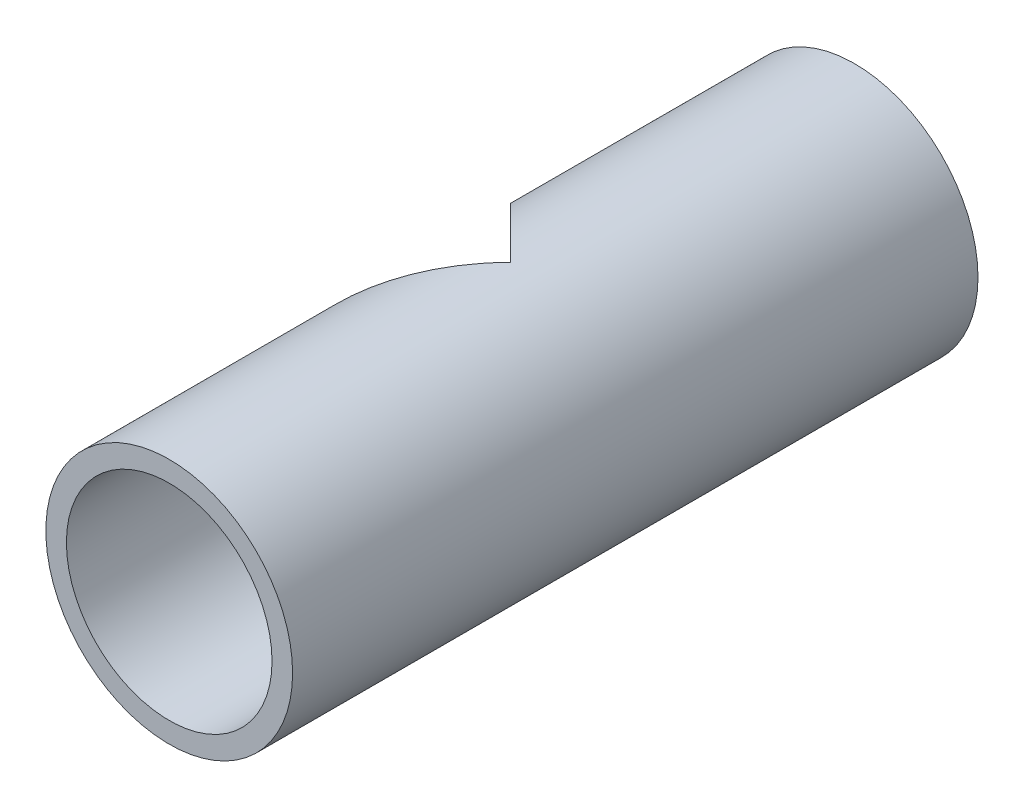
from build123d import *

# Parameters (mm, degrees)
SKETCH1_R           = 18
SKETCH1_R_2         = 15
BOSS_EXTRUDE1_DEPTH = 100
SKETCH2_R           = 18
CUT_EXTRUDE1_DEPTH  = 30


with BuildPart() as part:
    # Sketch1 → Boss-Extrude1 (new body)
    with BuildSketch(Plane.XY):
        Circle(SKETCH1_R)
        Circle(SKETCH1_R_2, mode=Mode.SUBTRACT)
    extrude(amount=BOSS_EXTRUDE1_DEPTH)

    # Sketch2 → Cut-Extrude1 (cut)
    with BuildSketch(Plane(origin=(0, 0, 0), x_dir=(0, 0, -1), z_dir=(1, 0, 0))):
        with Locations((-50.224135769, 0)):
            Circle(SKETCH2_R)
    extrude(amount=-CUT_EXTRUDE1_DEPTH, mode=Mode.SUBTRACT)


solid = part.part
